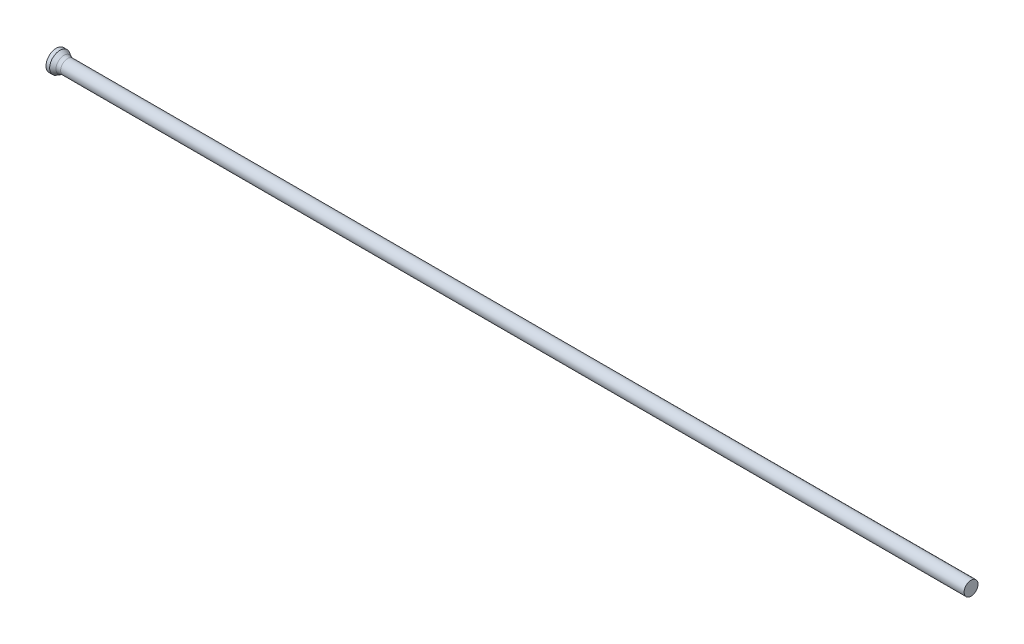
ISO-10303-21;
HEADER;
FILE_DESCRIPTION(('STEP AP214'),'2;1');
FILE_NAME('part.step','',(''),(''),'','','');
FILE_SCHEMA(('AUTOMOTIVE_DESIGN { 1 0 10303 214 1 1 1 1 }'));
ENDSEC;
DATA;
#1=APPLICATION_CONTEXT('core data for automotive mechanical design processes');
#2=APPLICATION_PROTOCOL_DEFINITION('international standard','automotive_design',2000,#1);
#3=PRODUCT_CONTEXT('',#1,'mechanical');
#4=PRODUCT('Part','Part','',(#3));
#5=PRODUCT_RELATED_PRODUCT_CATEGORY('part','',(#4));
#6=PRODUCT_DEFINITION_FORMATION('','',#4);
#7=PRODUCT_DEFINITION_CONTEXT('part definition',#1,'design');
#8=PRODUCT_DEFINITION('design','',#6,#7);
#9=PRODUCT_DEFINITION_SHAPE('','',#8);
#10=(LENGTH_UNIT() NAMED_UNIT(*) SI_UNIT(.MILLI.,.METRE.));
#11=(NAMED_UNIT(*) PLANE_ANGLE_UNIT() SI_UNIT($,.RADIAN.));
#12=(NAMED_UNIT(*) SI_UNIT($,.STERADIAN.) SOLID_ANGLE_UNIT());
#13=UNCERTAINTY_MEASURE_WITH_UNIT(LENGTH_MEASURE(1.E-05),#10,'distance_accuracy_value','');
#14=(GEOMETRIC_REPRESENTATION_CONTEXT(3) GLOBAL_UNCERTAINTY_ASSIGNED_CONTEXT((#13)) GLOBAL_UNIT_ASSIGNED_CONTEXT((#10,
#11,#12)) REPRESENTATION_CONTEXT('',''));
#15=CARTESIAN_POINT('',(0.,0.,0.));
#16=DIRECTION('',(0.,0.,1.));
#17=DIRECTION('',(1.,0.,0.));
#18=AXIS2_PLACEMENT_3D('',#15,#16,#17);
#19=CARTESIAN_POINT('',(0.,0.,0.));
#20=DIRECTION('',(1.,0.,0.));
#21=DIRECTION('',(0.,0.,-1.));
#22=AXIS2_PLACEMENT_3D('',#19,#20,#21);
#23=PLANE('',#22);
#24=CARTESIAN_POINT('',(0.,0.,0.));
#25=DIRECTION('',(-1.,0.,0.));
#26=DIRECTION('',(0.,0.,1.));
#27=AXIS2_PLACEMENT_3D('',#24,#25,#26);
#28=CIRCLE('',#27,1.4);
#29=CARTESIAN_POINT('',(0.,0.,1.4));
#30=VERTEX_POINT('',#29);
#31=EDGE_CURVE('E25',#30,#30,#28,.T.);
#32=ORIENTED_EDGE('',*,*,#31,.T.);
#33=EDGE_LOOP('',(#32));
#34=FACE_BOUND('',#33,.T.);
#35=ADVANCED_FACE('F14',(#34),#23,.F.);
#36=CARTESIAN_POINT('',(0.,0.,0.));
#37=DIRECTION('',(-1.,0.,0.));
#38=DIRECTION('',(0.,0.,1.));
#39=AXIS2_PLACEMENT_3D('',#36,#37,#38);
#40=CYLINDRICAL_SURFACE('',#39,1.4);
#41=ORIENTED_EDGE('',*,*,#31,.F.);
#42=EDGE_LOOP('',(#41));
#43=FACE_BOUND('',#42,.T.);
#44=CARTESIAN_POINT('',(0.500577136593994,0.,0.));
#45=DIRECTION('',(-1.,0.,0.));
#46=DIRECTION('',(0.,0.,1.));
#47=AXIS2_PLACEMENT_3D('',#44,#45,#46);
#48=CIRCLE('',#47,1.4);
#49=CARTESIAN_POINT('',(0.500577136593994,0.,1.4));
#50=VERTEX_POINT('',#49);
#51=EDGE_CURVE('E29',#50,#50,#48,.T.);
#52=ORIENTED_EDGE('',*,*,#51,.T.);
#53=EDGE_LOOP('',(#52));
#54=FACE_BOUND('',#53,.T.);
#55=ADVANCED_FACE('F53',(#43,#54),#40,.T.);
#56=CARTESIAN_POINT('',(1.28,0.,0.));
#57=DIRECTION('',(-1.,0.,0.));
#58=DIRECTION('',(0.,0.,1.));
#59=AXIS2_PLACEMENT_3D('',#56,#57,#58);
#60=CONICAL_SURFACE('',#59,0.95,0.523598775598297);
#61=CARTESIAN_POINT('',(1.04794919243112,0.,0.));
#62=DIRECTION('',(-1.,0.,0.));
#63=DIRECTION('',(0.,0.,1.));
#64=AXIS2_PLACEMENT_3D('',#61,#62,#63);
#65=CIRCLE('',#64,1.08397459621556);
#66=CARTESIAN_POINT('',(1.04794919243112,0.,1.08397459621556));
#67=VERTEX_POINT('',#66);
#68=EDGE_CURVE('E21',#67,#67,#65,.T.);
#69=ORIENTED_EDGE('',*,*,#68,.T.);
#70=EDGE_LOOP('',(#69));
#71=FACE_BOUND('',#70,.T.);
#72=ORIENTED_EDGE('',*,*,#51,.F.);
#73=EDGE_LOOP('',(#72));
#74=FACE_BOUND('',#73,.T.);
#75=ADVANCED_FACE('F50',(#71,#74),#60,.T.);
#76=CARTESIAN_POINT('',(0.,0.,0.));
#77=DIRECTION('',(-1.,0.,0.));
#78=DIRECTION('',(0.,0.,1.));
#79=AXIS2_PLACEMENT_3D('',#76,#77,#78);
#80=CYLINDRICAL_SURFACE('',#79,0.95);
#81=CARTESIAN_POINT('',(1.54794919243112,0.,0.));
#82=DIRECTION('',(-1.,0.,0.));
#83=DIRECTION('',(0.,0.,1.));
#84=AXIS2_PLACEMENT_3D('',#81,#82,#83);
#85=CIRCLE('',#84,0.95);
#86=CARTESIAN_POINT('',(1.54794919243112,0.,0.95));
#87=VERTEX_POINT('',#86);
#88=EDGE_CURVE('E9',#87,#87,#85,.F.);
#89=ORIENTED_EDGE('',*,*,#88,.T.);
#90=EDGE_LOOP('',(#89));
#91=FACE_BOUND('',#90,.T.);
#92=CARTESIAN_POINT('',(125.,0.,0.));
#93=DIRECTION('',(-1.,0.,0.));
#94=DIRECTION('',(0.,0.,1.));
#95=AXIS2_PLACEMENT_3D('',#92,#93,#94);
#96=CIRCLE('',#95,0.95);
#97=CARTESIAN_POINT('',(125.,0.,0.95));
#98=VERTEX_POINT('',#97);
#99=EDGE_CURVE('E34',#98,#98,#96,.T.);
#100=ORIENTED_EDGE('',*,*,#99,.T.);
#101=EDGE_LOOP('',(#100));
#102=FACE_BOUND('',#101,.T.);
#103=ADVANCED_FACE('F38',(#91,#102),#80,.T.);
#104=CARTESIAN_POINT('',(125.,0.95,0.));
#105=DIRECTION('',(-1.,0.,0.));
#106=DIRECTION('',(0.,0.,1.));
#107=AXIS2_PLACEMENT_3D('',#104,#105,#106);
#108=PLANE('',#107);
#109=ORIENTED_EDGE('',*,*,#99,.F.);
#110=EDGE_LOOP('',(#109));
#111=FACE_BOUND('',#110,.T.);
#112=ADVANCED_FACE('F40',(#111),#108,.F.);
#113=CARTESIAN_POINT('',(1.54794919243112,0.,0.));
#114=DIRECTION('',(-1.,0.,0.));
#115=DIRECTION('',(0.,0.,1.));
#116=AXIS2_PLACEMENT_3D('',#113,#114,#115);
#117=TOROIDAL_SURFACE('',#116,1.95,1.);
#118=ORIENTED_EDGE('',*,*,#88,.F.);
#119=EDGE_LOOP('',(#118));
#120=FACE_BOUND('',#119,.T.);
#121=ORIENTED_EDGE('',*,*,#68,.F.);
#122=EDGE_LOOP('',(#121));
#123=FACE_BOUND('',#122,.T.);
#124=ADVANCED_FACE('F16',(#120,#123),#117,.F.);
#125=CLOSED_SHELL('',(#35,#55,#75,#103,#112,#124));
#126=MANIFOLD_SOLID_BREP('B1',#125);
#127=ADVANCED_BREP_SHAPE_REPRESENTATION('',(#18,#126),#14);
#128=SHAPE_DEFINITION_REPRESENTATION(#9,#127);
ENDSEC;
END-ISO-10303-21;
